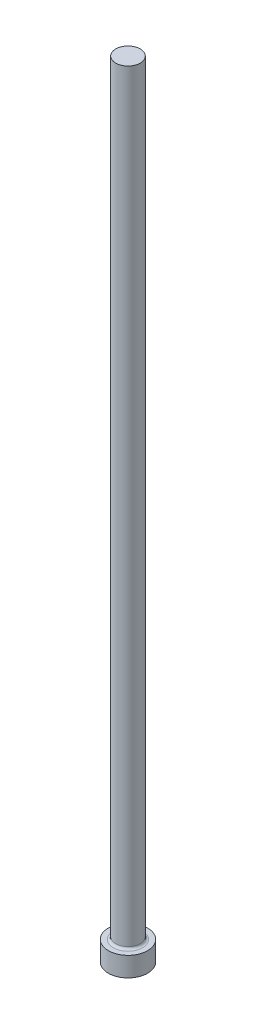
from build123d import *


with BuildPart() as part:
    # Sketch1 → Revolve1 (revolve)
    with BuildSketch(Plane.XY, mode=Mode.PRIVATE) as revolve1_sk:
        with BuildLine():
            Line((0, 0), (6.35, 0))
            Line((6.35, 0), (6.35, 6.35))
            Line((6.35, 6.35), (4.73075, 6.35))
            ThreePointArc((4.73075, 6.35), (4.191934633, 6.573184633), (3.96875, 7.112))
            Line((3.96875, 7.112), (3.96875, 254))
            Line((3.96875, 254), (0, 254))
            Line((0, 254), (0, 0))
        make_face()
    revolve(revolve1_sk.sketch.rotate(Axis((0, 254, 0), (0, -1, 0)), 180), axis=Axis((0, 254, 0), (0, -1, 0)))


solid = part.part
